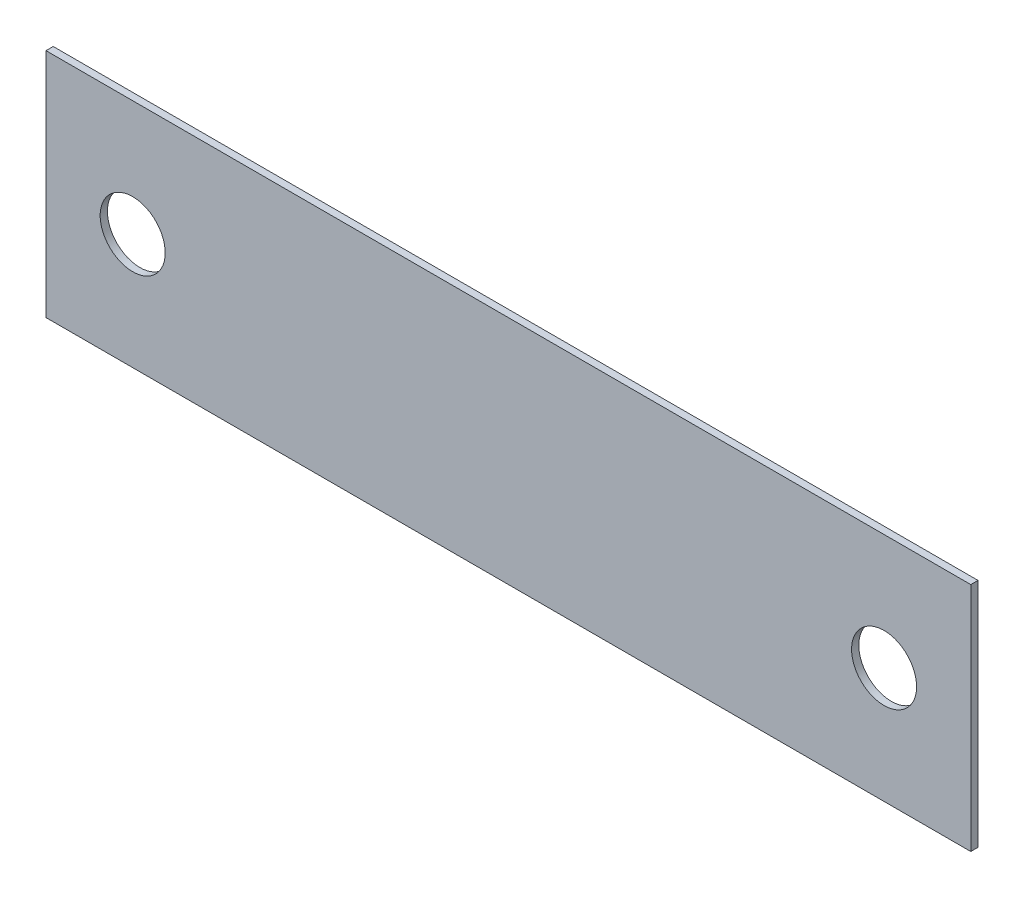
ISO-10303-21;
HEADER;
FILE_DESCRIPTION(('STEP AP214'),'2;1');
FILE_NAME('part.step','',(''),(''),'','','');
FILE_SCHEMA(('AUTOMOTIVE_DESIGN { 1 0 10303 214 1 1 1 1 }'));
ENDSEC;
DATA;
#1=APPLICATION_CONTEXT('core data for automotive mechanical design processes');
#2=APPLICATION_PROTOCOL_DEFINITION('international standard','automotive_design',2000,#1);
#3=PRODUCT_CONTEXT('',#1,'mechanical');
#4=PRODUCT('Part','Part','',(#3));
#5=PRODUCT_RELATED_PRODUCT_CATEGORY('part','',(#4));
#6=PRODUCT_DEFINITION_FORMATION('','',#4);
#7=PRODUCT_DEFINITION_CONTEXT('part definition',#1,'design');
#8=PRODUCT_DEFINITION('design','',#6,#7);
#9=PRODUCT_DEFINITION_SHAPE('','',#8);
#10=(LENGTH_UNIT() NAMED_UNIT(*) SI_UNIT(.MILLI.,.METRE.));
#11=(NAMED_UNIT(*) PLANE_ANGLE_UNIT() SI_UNIT($,.RADIAN.));
#12=(NAMED_UNIT(*) SI_UNIT($,.STERADIAN.) SOLID_ANGLE_UNIT());
#13=UNCERTAINTY_MEASURE_WITH_UNIT(LENGTH_MEASURE(1.E-05),#10,'distance_accuracy_value','');
#14=(GEOMETRIC_REPRESENTATION_CONTEXT(3) GLOBAL_UNCERTAINTY_ASSIGNED_CONTEXT((#13)) GLOBAL_UNIT_ASSIGNED_CONTEXT((#10,
#11,#12)) REPRESENTATION_CONTEXT('',''));
#15=CARTESIAN_POINT('',(0.,0.,0.));
#16=DIRECTION('',(0.,0.,1.));
#17=DIRECTION('',(1.,0.,0.));
#18=AXIS2_PLACEMENT_3D('',#15,#16,#17);
#19=CARTESIAN_POINT('',(-101.6,25.4,1.5875));
#20=DIRECTION('',(0.,-1.,0.));
#21=DIRECTION('',(1.,0.,0.));
#22=AXIS2_PLACEMENT_3D('',#19,#20,#21);
#23=PLANE('',#22);
#24=DIRECTION('',(-1.,0.,0.));
#25=VECTOR('',#24,1.);
#26=CARTESIAN_POINT('',(-101.6,25.4,0.));
#27=LINE('',#26,#25);
#28=CARTESIAN_POINT('',(101.6,25.4,0.));
#29=VERTEX_POINT('',#28);
#30=CARTESIAN_POINT('',(-101.6,25.4,0.));
#31=VERTEX_POINT('',#30);
#32=EDGE_CURVE('E257',#29,#31,#27,.T.);
#33=ORIENTED_EDGE('',*,*,#32,.T.);
#34=DIRECTION('',(0.,0.,-1.));
#35=VECTOR('',#34,1.);
#36=CARTESIAN_POINT('',(-101.6,25.4,1.5875));
#37=LINE('',#36,#35);
#38=CARTESIAN_POINT('',(-101.6,25.4,1.5875));
#39=VERTEX_POINT('',#38);
#40=EDGE_CURVE('E12',#39,#31,#37,.T.);
#41=ORIENTED_EDGE('',*,*,#40,.F.);
#42=DIRECTION('',(-1.,0.,0.));
#43=VECTOR('',#42,1.);
#44=CARTESIAN_POINT('',(-101.6,25.4,1.5875));
#45=LINE('',#44,#43);
#46=CARTESIAN_POINT('',(101.6,25.4,1.5875));
#47=VERTEX_POINT('',#46);
#48=EDGE_CURVE('E238',#47,#39,#45,.T.);
#49=ORIENTED_EDGE('',*,*,#48,.F.);
#50=DIRECTION('',(0.,0.,-1.));
#51=VECTOR('',#50,1.);
#52=CARTESIAN_POINT('',(101.6,25.4,1.5875));
#53=LINE('',#52,#51);
#54=EDGE_CURVE('E253',#47,#29,#53,.T.);
#55=ORIENTED_EDGE('',*,*,#54,.T.);
#56=EDGE_LOOP('',(#33,#41,#49,#55));
#57=FACE_BOUND('',#56,.T.);
#58=ADVANCED_FACE('F187',(#57),#23,.F.);
#59=CARTESIAN_POINT('',(-101.6,-25.4,1.5875));
#60=DIRECTION('',(1.,0.,0.));
#61=DIRECTION('',(0.,0.,-1.));
#62=AXIS2_PLACEMENT_3D('',#59,#60,#61);
#63=PLANE('',#62);
#64=DIRECTION('',(0.,-1.,0.));
#65=VECTOR('',#64,1.);
#66=CARTESIAN_POINT('',(-101.6,-25.4,0.));
#67=LINE('',#66,#65);
#68=CARTESIAN_POINT('',(-101.6,-25.4,0.));
#69=VERTEX_POINT('',#68);
#70=EDGE_CURVE('E241',#31,#69,#67,.T.);
#71=ORIENTED_EDGE('',*,*,#70,.T.);
#72=DIRECTION('',(0.,0.,-1.));
#73=VECTOR('',#72,1.);
#74=CARTESIAN_POINT('',(-101.6,-25.4,1.5875));
#75=LINE('',#74,#73);
#76=CARTESIAN_POINT('',(-101.6,-25.4,1.5875));
#77=VERTEX_POINT('',#76);
#78=EDGE_CURVE('E200',#77,#69,#75,.T.);
#79=ORIENTED_EDGE('',*,*,#78,.F.);
#80=DIRECTION('',(0.,-1.,0.));
#81=VECTOR('',#80,1.);
#82=CARTESIAN_POINT('',(-101.6,-25.4,1.5875));
#83=LINE('',#82,#81);
#84=EDGE_CURVE('E234',#39,#77,#83,.T.);
#85=ORIENTED_EDGE('',*,*,#84,.F.);
#86=ORIENTED_EDGE('',*,*,#40,.T.);
#87=EDGE_LOOP('',(#71,#79,#85,#86));
#88=FACE_BOUND('',#87,.T.);
#89=ADVANCED_FACE('F244',(#88),#63,.F.);
#90=CARTESIAN_POINT('',(-101.6,-25.4,1.5875));
#91=DIRECTION('',(0.,1.,0.));
#92=DIRECTION('',(-1.,0.,0.));
#93=AXIS2_PLACEMENT_3D('',#90,#91,#92);
#94=PLANE('',#93);
#95=DIRECTION('',(1.,0.,0.));
#96=VECTOR('',#95,1.);
#97=CARTESIAN_POINT('',(-101.6,-25.4,0.));
#98=LINE('',#97,#96);
#99=CARTESIAN_POINT('',(101.6,-25.4,0.));
#100=VERTEX_POINT('',#99);
#101=EDGE_CURVE('E225',#69,#100,#98,.T.);
#102=ORIENTED_EDGE('',*,*,#101,.T.);
#103=DIRECTION('',(0.,0.,-1.));
#104=VECTOR('',#103,1.);
#105=CARTESIAN_POINT('',(101.6,-25.4,1.5875));
#106=LINE('',#105,#104);
#107=CARTESIAN_POINT('',(101.6,-25.4,1.5875));
#108=VERTEX_POINT('',#107);
#109=EDGE_CURVE('E250',#108,#100,#106,.T.);
#110=ORIENTED_EDGE('',*,*,#109,.F.);
#111=DIRECTION('',(1.,0.,0.));
#112=VECTOR('',#111,1.);
#113=CARTESIAN_POINT('',(-101.6,-25.4,1.5875));
#114=LINE('',#113,#112);
#115=EDGE_CURVE('E239',#77,#108,#114,.T.);
#116=ORIENTED_EDGE('',*,*,#115,.F.);
#117=ORIENTED_EDGE('',*,*,#78,.T.);
#118=EDGE_LOOP('',(#102,#110,#116,#117));
#119=FACE_BOUND('',#118,.T.);
#120=ADVANCED_FACE('F246',(#119),#94,.F.);
#121=CARTESIAN_POINT('',(101.6,-25.4,1.5875));
#122=DIRECTION('',(-1.,0.,0.));
#123=DIRECTION('',(0.,0.,1.));
#124=AXIS2_PLACEMENT_3D('',#121,#122,#123);
#125=PLANE('',#124);
#126=DIRECTION('',(0.,1.,0.));
#127=VECTOR('',#126,1.);
#128=CARTESIAN_POINT('',(101.6,-25.4,0.));
#129=LINE('',#128,#127);
#130=EDGE_CURVE('E228',#100,#29,#129,.T.);
#131=ORIENTED_EDGE('',*,*,#130,.T.);
#132=ORIENTED_EDGE('',*,*,#54,.F.);
#133=DIRECTION('',(0.,1.,0.));
#134=VECTOR('',#133,1.);
#135=CARTESIAN_POINT('',(101.6,-25.4,1.5875));
#136=LINE('',#135,#134);
#137=EDGE_CURVE('E203',#108,#47,#136,.T.);
#138=ORIENTED_EDGE('',*,*,#137,.F.);
#139=ORIENTED_EDGE('',*,*,#109,.T.);
#140=EDGE_LOOP('',(#131,#132,#138,#139));
#141=FACE_BOUND('',#140,.T.);
#142=ADVANCED_FACE('F275',(#141),#125,.F.);
#143=CARTESIAN_POINT('',(0.,0.,1.5875));
#144=DIRECTION('',(0.,0.,1.));
#145=DIRECTION('',(1.,0.,0.));
#146=AXIS2_PLACEMENT_3D('',#143,#144,#145);
#147=PLANE('',#146);
#148=CARTESIAN_POINT('',(82.55,0.,1.5875));
#149=DIRECTION('',(0.,0.,1.));
#150=DIRECTION('',(1.,0.,0.));
#151=AXIS2_PLACEMENT_3D('',#148,#149,#150);
#152=CIRCLE('',#151,7.14375);
#153=CARTESIAN_POINT('',(89.69375,0.,1.5875));
#154=VERTEX_POINT('',#153);
#155=EDGE_CURVE('E263',#154,#154,#152,.T.);
#156=ORIENTED_EDGE('',*,*,#155,.F.);
#157=EDGE_LOOP('',(#156));
#158=FACE_BOUND('',#157,.T.);
#159=CARTESIAN_POINT('',(-82.55,0.,1.5875));
#160=DIRECTION('',(0.,0.,1.));
#161=DIRECTION('',(1.,0.,0.));
#162=AXIS2_PLACEMENT_3D('',#159,#160,#161);
#163=CIRCLE('',#162,7.14375000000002);
#164=CARTESIAN_POINT('',(-75.40625,0.,1.5875));
#165=VERTEX_POINT('',#164);
#166=EDGE_CURVE('E279',#165,#165,#163,.T.);
#167=ORIENTED_EDGE('',*,*,#166,.F.);
#168=EDGE_LOOP('',(#167));
#169=FACE_BOUND('',#168,.T.);
#170=ORIENTED_EDGE('',*,*,#48,.T.);
#171=ORIENTED_EDGE('',*,*,#84,.T.);
#172=ORIENTED_EDGE('',*,*,#115,.T.);
#173=ORIENTED_EDGE('',*,*,#137,.T.);
#174=EDGE_LOOP('',(#170,#171,#172,#173));
#175=FACE_BOUND('',#174,.T.);
#176=ADVANCED_FACE('F237',(#158,#169,#175),#147,.T.);
#177=CARTESIAN_POINT('',(0.,0.,0.));
#178=DIRECTION('',(0.,0.,1.));
#179=DIRECTION('',(1.,0.,0.));
#180=AXIS2_PLACEMENT_3D('',#177,#178,#179);
#181=PLANE('',#180);
#182=CARTESIAN_POINT('',(82.55,0.,0.));
#183=DIRECTION('',(0.,0.,1.));
#184=DIRECTION('',(1.,0.,0.));
#185=AXIS2_PLACEMENT_3D('',#182,#183,#184);
#186=CIRCLE('',#185,7.14375);
#187=CARTESIAN_POINT('',(89.69375,0.,0.));
#188=VERTEX_POINT('',#187);
#189=EDGE_CURVE('E288',#188,#188,#186,.T.);
#190=ORIENTED_EDGE('',*,*,#189,.T.);
#191=EDGE_LOOP('',(#190));
#192=FACE_BOUND('',#191,.T.);
#193=CARTESIAN_POINT('',(-82.55,0.,0.));
#194=DIRECTION('',(0.,0.,1.));
#195=DIRECTION('',(1.,0.,0.));
#196=AXIS2_PLACEMENT_3D('',#193,#194,#195);
#197=CIRCLE('',#196,7.14375000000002);
#198=CARTESIAN_POINT('',(-75.40625,0.,0.));
#199=VERTEX_POINT('',#198);
#200=EDGE_CURVE('E281',#199,#199,#197,.T.);
#201=ORIENTED_EDGE('',*,*,#200,.T.);
#202=EDGE_LOOP('',(#201));
#203=FACE_BOUND('',#202,.T.);
#204=ORIENTED_EDGE('',*,*,#32,.F.);
#205=ORIENTED_EDGE('',*,*,#130,.F.);
#206=ORIENTED_EDGE('',*,*,#101,.F.);
#207=ORIENTED_EDGE('',*,*,#70,.F.);
#208=EDGE_LOOP('',(#204,#205,#206,#207));
#209=FACE_BOUND('',#208,.T.);
#210=ADVANCED_FACE('F274',(#192,#203,#209),#181,.F.);
#211=CARTESIAN_POINT('',(-82.55,0.,1.5875));
#212=DIRECTION('',(0.,0.,-1.));
#213=DIRECTION('',(-1.,0.,0.));
#214=AXIS2_PLACEMENT_3D('',#211,#212,#213);
#215=CYLINDRICAL_SURFACE('',#214,7.14375000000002);
#216=ORIENTED_EDGE('',*,*,#166,.T.);
#217=EDGE_LOOP('',(#216));
#218=FACE_BOUND('',#217,.T.);
#219=ORIENTED_EDGE('',*,*,#200,.F.);
#220=EDGE_LOOP('',(#219));
#221=FACE_BOUND('',#220,.T.);
#222=ADVANCED_FACE('F304',(#218,#221),#215,.F.);
#223=CARTESIAN_POINT('',(82.55,0.,1.5875));
#224=DIRECTION('',(0.,0.,-1.));
#225=DIRECTION('',(-1.,0.,0.));
#226=AXIS2_PLACEMENT_3D('',#223,#224,#225);
#227=CYLINDRICAL_SURFACE('',#226,7.14375);
#228=ORIENTED_EDGE('',*,*,#155,.T.);
#229=EDGE_LOOP('',(#228));
#230=FACE_BOUND('',#229,.T.);
#231=ORIENTED_EDGE('',*,*,#189,.F.);
#232=EDGE_LOOP('',(#231));
#233=FACE_BOUND('',#232,.T.);
#234=ADVANCED_FACE('F300',(#230,#233),#227,.F.);
#235=CLOSED_SHELL('',(#58,#89,#120,#142,#176,#210,#222,#234));
#236=MANIFOLD_SOLID_BREP('B2',#235);
#237=ADVANCED_BREP_SHAPE_REPRESENTATION('',(#18,#236),#14);
#238=SHAPE_DEFINITION_REPRESENTATION(#9,#237);
ENDSEC;
END-ISO-10303-21;
